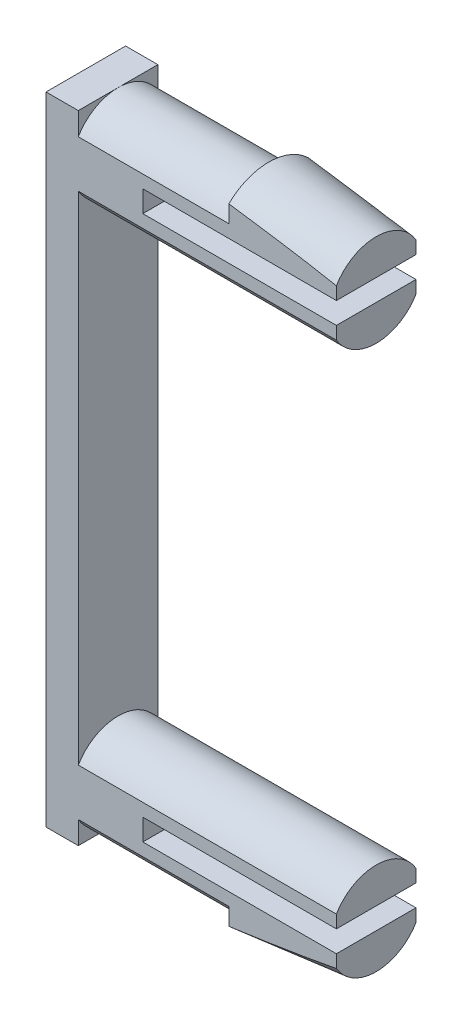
from build123d import *

# Parameters (mm, degrees)
BOSS_EXTRUDE2_DEPTH      = 2.25
REVOLVE4_ANGLE           = 90
REVOLVE4_OTHER_WAY_ANGLE = 90
SKETCH1_9_W              = 12
SKETCH1_9_H              = 2.15
REVOLVE6_ANGLE           = 90
REVOLVE6_OTHER_WAY_ANGLE = 90
SKETCH1_8_W              = 12
SKETCH1_8_H              = 2.15
REVOLVE5_ANGLE           = 90
REVOLVE5_OTHER_WAY_ANGLE = 90
REVOLVE7_ANGLE           = 90
REVOLVE7_OTHER_WAY_ANGLE = 90
SKETCH2_W                = 0.4
SKETCH2_H                = 29.6
SKETCH2_W_2              = 2
SKETCH2_W_3              = 1.6
CUT_EXTRUDE1_DEPTH       = 21.575774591
CUT_EXTRUDE2_REACH       = 22.257
SKETCH3_W                = 9
SKETCH3_H                = 1


with BuildPart() as part:
    # Sketch1 → Boss-Extrude2 (new, symmetric)
    with BuildSketch(Plane.XY):
        Polygon((0.75, 14.8), (-0.75, 14.8), (-0.75, -14.8), (0.75, -14.8), (0.75, -12.65), (0.75, -10.5), (0.75, 10.5), (0.75, 12.65), align=None)
    extrude(amount=BOSS_EXTRUDE2_DEPTH, both=True)

    # Sketch1_7 → Revolve4 (revolve)
    with BuildSketch(Plane.XY):
        Polygon((7.75, 14.8), (0.75, 14.8), (0.75, 12.65), (12.75, 12.65), (12.75, 14.8), (7.75, 15.3), align=None)
    revolve(axis=Axis((0.75, 12.65, 0), (1, 0, 0)), revolution_arc=REVOLVE4_ANGLE)

    # Sketch1_7 → Revolve4 other way (revolve)
    with BuildSketch(Plane.XY):
        Polygon((7.75, 14.8), (0.75, 14.8), (0.75, 12.65), (12.75, 12.65), (12.75, 14.8), (7.75, 15.3), align=None)
    revolve(axis=Axis((0.75, 12.65, 0), (-1, 0, 0)), revolution_arc=REVOLVE4_OTHER_WAY_ANGLE)

    # Sketch1_9 → Revolve6 (revolve)
    with BuildSketch(Plane.XY):
        with Locations((6.75, 11.575)):
            Rectangle(SKETCH1_9_W, SKETCH1_9_H)
    revolve(axis=Axis((0.75, 12.65, 0), (1, 0, 0)), revolution_arc=REVOLVE6_ANGLE)

    # Sketch1_9 → Revolve6 other way (revolve)
    with BuildSketch(Plane.XY):
        with Locations((6.75, 11.575)):
            Rectangle(SKETCH1_9_W, SKETCH1_9_H)
    revolve(axis=Axis((0.75, 12.65, 0), (-1, 0, 0)), revolution_arc=REVOLVE6_OTHER_WAY_ANGLE)

    # Sketch1_8 → Revolve5 (revolve)
    with BuildSketch(Plane.XY):
        with Locations((6.75, -11.575)):
            Rectangle(SKETCH1_8_W, SKETCH1_8_H)
    revolve(axis=Axis((0.75, -12.65, 0), (1, 0, 0)), revolution_arc=REVOLVE5_ANGLE)

    # Sketch1_8 → Revolve5 other way (revolve)
    with BuildSketch(Plane.XY):
        with Locations((6.75, -11.575)):
            Rectangle(SKETCH1_8_W, SKETCH1_8_H)
    revolve(axis=Axis((0.75, -12.65, 0), (-1, 0, 0)), revolution_arc=REVOLVE5_OTHER_WAY_ANGLE)

    # Sketch1_10 → Revolve7 (revolve)
    with BuildSketch(Plane.XY):
        Polygon((0.75, -12.65), (0.75, -14.8), (7.75, -14.8), (7.75, -15.3), (12.75, -14.8), (12.75, -12.65), align=None)
    revolve(axis=Axis((0.75, -12.65, 0), (1, 0, 0)), revolution_arc=REVOLVE7_ANGLE)

    # Sketch1_10 → Revolve7 other way (revolve)
    with BuildSketch(Plane.XY):
        Polygon((0.75, -12.65), (0.75, -14.8), (7.75, -14.8), (7.75, -15.3), (12.75, -14.8), (12.75, -12.65), align=None)
    revolve(axis=Axis((0.75, -12.65, 0), (-1, 0, 0)), revolution_arc=REVOLVE7_OTHER_WAY_ANGLE)

    # Sketch2 → Cut-Extrude1 (cut, through all)
    with BuildSketch(Plane.ZY.offset(0.75)):
        with Locations((2.05, 0)):
            Rectangle(SKETCH2_W, SKETCH2_H)
        with Locations((-2.05, 0)):
            Rectangle(SKETCH2_W, SKETCH2_H)
        with Locations((-3.25, 0)):
            Rectangle(SKETCH2_W_2, SKETCH2_H)
        with Locations((3.05, 0)):
            Rectangle(SKETCH2_W_3, SKETCH2_H)
    extrude(amount=-CUT_EXTRUDE1_DEPTH, mode=Mode.SUBTRACT)

    # Sketch3 → Cut-Extrude2 (cut, up to next)
    with BuildSketch(Plane(origin=(0, 0, -1.85), x_dir=(-1, 0, 0), z_dir=(0, 0, -1)), mode=Mode.PRIVATE) as cut_extrude2_sk1:
        with Locations((-8.25, 12.65)):
            Rectangle(SKETCH3_W, SKETCH3_H)
    cut_extrude2_tool1 = extrude(cut_extrude2_sk1.sketch, amount=-CUT_EXTRUDE2_REACH, mode=Mode.PRIVATE) & part.part
    # Sketch3 → Cut-Extrude2 (cut, up to next)
    with BuildSketch(Plane(origin=(0, 0, -1.85), x_dir=(-1, 0, 0), z_dir=(0, 0, -1)), mode=Mode.PRIVATE) as cut_extrude2_sk2:
        with Locations((-8.25, -12.65)):
            Rectangle(SKETCH3_W, SKETCH3_H)
    cut_extrude2_tool2 = extrude(cut_extrude2_sk2.sketch, amount=-CUT_EXTRUDE2_REACH, mode=Mode.PRIVATE) & part.part
    add(cut_extrude2_tool1.solids().sort_by_distance((8.25, 12.65, -1.85))[0], mode=Mode.SUBTRACT)
    add(cut_extrude2_tool2.solids().sort_by_distance((8.25, -12.65, -1.85))[0], mode=Mode.SUBTRACT)


solid = part.part
